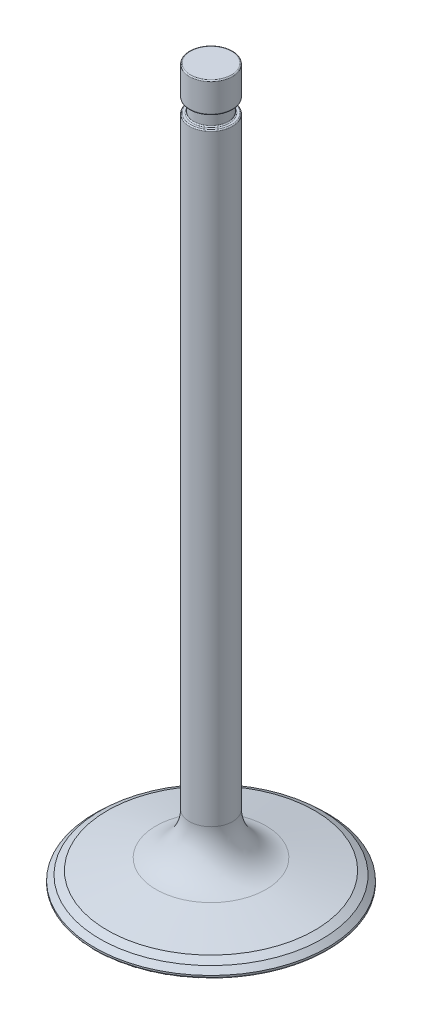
from build123d import *

# Parameters (mm, degrees)
FILLET1_R      = 10
CHAMFER1_SIZE  = 2
CHAMFER1_SIZE2 = 1.36299339
CHAMFER3_SIZE  = 1
CHAMFER3_SIZE2 = 0.999999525
FILLET2_R      = 0.25


with BuildPart() as part:
    # Sketch1 → Revolve1 (revolve)
    with BuildSketch(Plane.XY, mode=Mode.PRIVATE) as revolve1_sk:
        Polygon((0, 0), (0, 165), (-5, 165), (-5, 158), (-4, 158), (-4, 155), (-5, 155), (-5, 7), (-27, 2), (-27, 0), align=None)
    revolve(revolve1_sk.sketch.rotate(Axis((0, 0, 0), (0, 1, 0)), 270), axis=Axis((0, 0, 0), (0, 1, 0)))

    # Fillet1
    fillet1_edges = [part.edges().sort_by_distance(p)[0] for p in [
        (0, 7, 5),
    ]]
    fillet(fillet1_edges, radius=FILLET1_R)

    # Chamfer1
    chamfer1_edges = [part.edges().sort_by_distance(p)[0] for p in [
        (0, 2, 27),
    ]]
    chamfer1_side = [part.faces().sort_by_distance(p)[0] for p in [
        (0, 3.615478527, 19.891894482),
    ]]
    chamfer(chamfer1_edges, length=CHAMFER1_SIZE, length2=CHAMFER1_SIZE2, reference=chamfer1_side[0])

    # Chamfer3
    chamfer3_edges = [part.edges().sort_by_distance(p)[0] for p in [
        (0, 2.443242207, 25.049727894),
    ]]
    chamfer3_side = [part.faces().sort_by_distance(p)[0] for p in [
        (0, 3.83709963, 18.916761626),
    ]]
    chamfer(chamfer3_edges, length=CHAMFER3_SIZE, length2=CHAMFER3_SIZE2, reference=chamfer3_side[0])

    # Fillet2
    fillet2_edges = [part.edges().sort_by_distance(p)[0] for p in [
        (0, 0, 27),
        (0, 165, 5),
        (0, 158, 5),
        (0, 158, 4),
        (0, 155, 4),
        (0, 155, 5),
    ]]
    fillet(fillet2_edges, radius=FILLET2_R)


solid = part.part
